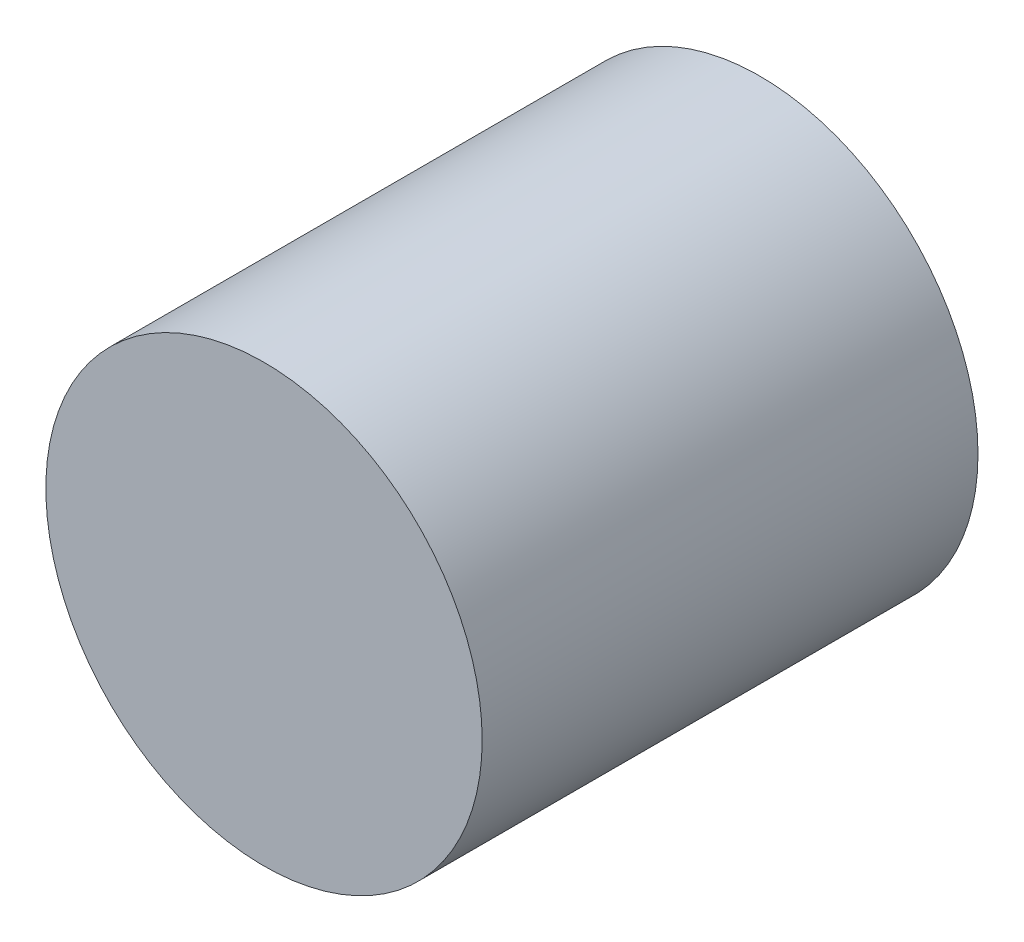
ISO-10303-21;
HEADER;
FILE_DESCRIPTION(('STEP AP214'),'2;1');
FILE_NAME('part.step','',(''),(''),'','','');
FILE_SCHEMA(('AUTOMOTIVE_DESIGN { 1 0 10303 214 1 1 1 1 }'));
ENDSEC;
DATA;
#1=APPLICATION_CONTEXT('core data for automotive mechanical design processes');
#2=APPLICATION_PROTOCOL_DEFINITION('international standard','automotive_design',2000,#1);
#3=PRODUCT_CONTEXT('',#1,'mechanical');
#4=PRODUCT('Part','Part','',(#3));
#5=PRODUCT_RELATED_PRODUCT_CATEGORY('part','',(#4));
#6=PRODUCT_DEFINITION_FORMATION('','',#4);
#7=PRODUCT_DEFINITION_CONTEXT('part definition',#1,'design');
#8=PRODUCT_DEFINITION('design','',#6,#7);
#9=PRODUCT_DEFINITION_SHAPE('','',#8);
#10=(LENGTH_UNIT() NAMED_UNIT(*) SI_UNIT(.MILLI.,.METRE.));
#11=(NAMED_UNIT(*) PLANE_ANGLE_UNIT() SI_UNIT($,.RADIAN.));
#12=(NAMED_UNIT(*) SI_UNIT($,.STERADIAN.) SOLID_ANGLE_UNIT());
#13=UNCERTAINTY_MEASURE_WITH_UNIT(LENGTH_MEASURE(1.E-05),#10,'distance_accuracy_value','');
#14=(GEOMETRIC_REPRESENTATION_CONTEXT(3) GLOBAL_UNCERTAINTY_ASSIGNED_CONTEXT((#13)) GLOBAL_UNIT_ASSIGNED_CONTEXT((#10,
#11,#12)) REPRESENTATION_CONTEXT('',''));
#15=CARTESIAN_POINT('',(0.,0.,0.));
#16=DIRECTION('',(0.,0.,1.));
#17=DIRECTION('',(1.,0.,0.));
#18=AXIS2_PLACEMENT_3D('',#15,#16,#17);
#19=CARTESIAN_POINT('',(195.925625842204,-4.47558656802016E-13,25.));
#20=DIRECTION('',(0.,0.,-1.));
#21=DIRECTION('',(-1.,0.,0.));
#22=AXIS2_PLACEMENT_3D('',#19,#20,#21);
#23=CYLINDRICAL_SURFACE('',#22,22.0000000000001);
#24=CARTESIAN_POINT('',(195.925625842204,-4.47558656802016E-13,25.));
#25=DIRECTION('',(0.,0.,1.));
#26=DIRECTION('',(1.,0.,0.));
#27=AXIS2_PLACEMENT_3D('',#24,#25,#26);
#28=CIRCLE('',#27,22.0000000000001);
#29=CARTESIAN_POINT('',(217.925625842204,-4.47558656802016E-13,25.));
#30=VERTEX_POINT('',#29);
#31=EDGE_CURVE('E10',#30,#30,#28,.T.);
#32=ORIENTED_EDGE('',*,*,#31,.F.);
#33=EDGE_LOOP('',(#32));
#34=FACE_BOUND('',#33,.T.);
#35=CARTESIAN_POINT('',(195.925625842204,-4.47558656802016E-13,-25.));
#36=DIRECTION('',(0.,0.,1.));
#37=DIRECTION('',(1.,0.,0.));
#38=AXIS2_PLACEMENT_3D('',#35,#36,#37);
#39=CIRCLE('',#38,22.0000000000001);
#40=CARTESIAN_POINT('',(217.925625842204,-4.47558656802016E-13,-25.));
#41=VERTEX_POINT('',#40);
#42=EDGE_CURVE('E35',#41,#41,#39,.T.);
#43=ORIENTED_EDGE('',*,*,#42,.T.);
#44=EDGE_LOOP('',(#43));
#45=FACE_BOUND('',#44,.T.);
#46=ADVANCED_FACE('F29',(#34,#45),#23,.T.);
#47=CARTESIAN_POINT('',(195.925625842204,-4.47558656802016E-13,25.));
#48=DIRECTION('',(0.,0.,1.));
#49=DIRECTION('',(1.,0.,0.));
#50=AXIS2_PLACEMENT_3D('',#47,#48,#49);
#51=PLANE('',#50);
#52=ORIENTED_EDGE('',*,*,#31,.T.);
#53=EDGE_LOOP('',(#52));
#54=FACE_BOUND('',#53,.T.);
#55=ADVANCED_FACE('F44',(#54),#51,.T.);
#56=CARTESIAN_POINT('',(195.925625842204,-4.47558656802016E-13,-25.));
#57=DIRECTION('',(0.,0.,1.));
#58=DIRECTION('',(1.,0.,0.));
#59=AXIS2_PLACEMENT_3D('',#56,#57,#58);
#60=PLANE('',#59);
#61=ORIENTED_EDGE('',*,*,#42,.F.);
#62=EDGE_LOOP('',(#61));
#63=FACE_BOUND('',#62,.T.);
#64=ADVANCED_FACE('F42',(#63),#60,.F.);
#65=CLOSED_SHELL('',(#46,#55,#64));
#66=MANIFOLD_SOLID_BREP('B2',#65);
#67=ADVANCED_BREP_SHAPE_REPRESENTATION('',(#18,#66),#14);
#68=SHAPE_DEFINITION_REPRESENTATION(#9,#67);
ENDSEC;
END-ISO-10303-21;
